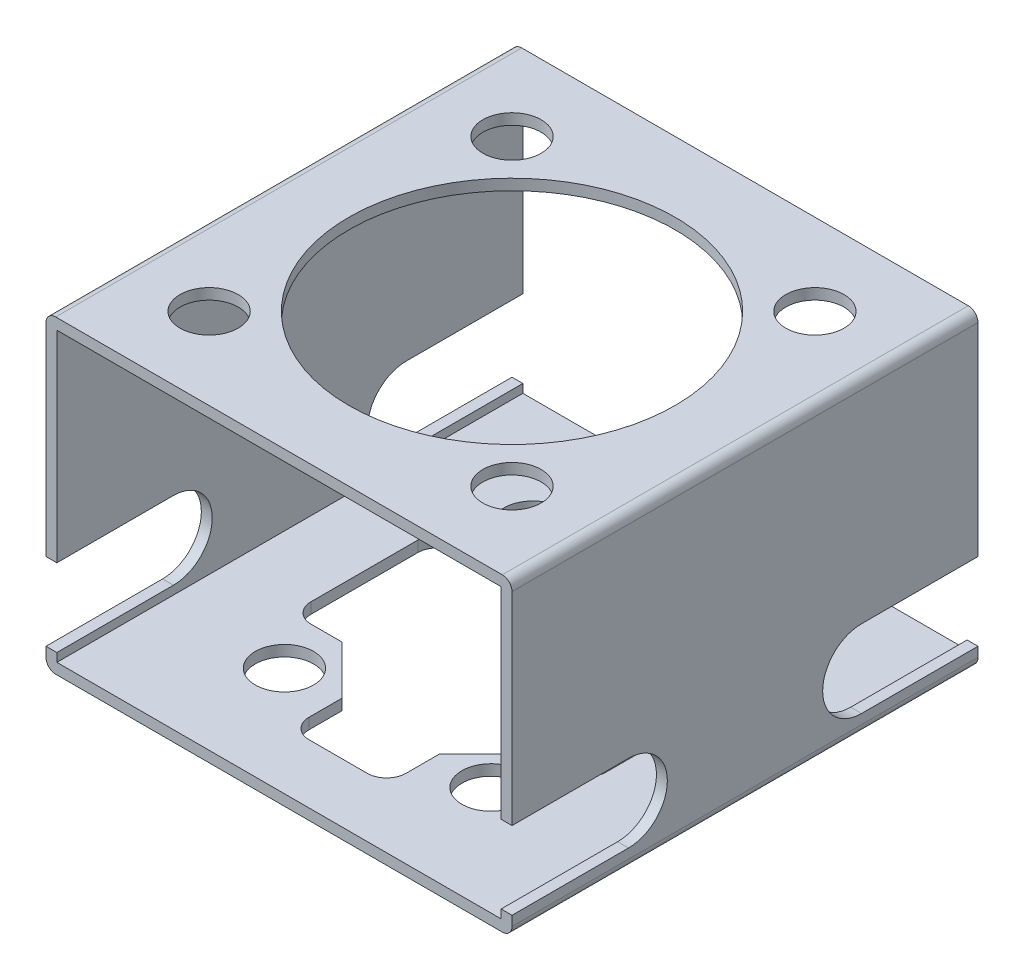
from build123d import *

# Parameters (mm, degrees)
SKETCH1_W          = 72.644
SKETCH1_H          = 47.0408
EXTRUDE1_DEPTH     = 38.1
CUT_EXTRUDE4_DEPTH = 100.086256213
SKETCH3_R          = 26.67
SKETCH3_R_2        = 4.7625
CUT_EXTRUDE5_DEPTH = 1.778
SKETCH4_R          = 4.7625
CUT_EXTRUDE6_DEPTH = 1.778
CUT_EXTRUDE7_DEPTH = 1.778
FILLET1_R          = 3.175


with BuildPart() as part:
    # Sketch1 → Extrude1 (new, symmetric)
    with BuildSketch(Plane.XY):
        with BuildLine():
            Line((1.5875, 0), (74.6125, 0))
            ThreePointArc((74.6125, 0), (75.735032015, 0.464967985), (76.2, 1.5875))
            Line((76.2, 1.5875), (76.2, 49.0093))
            ThreePointArc((76.2, 49.0093), (75.735032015, 50.131832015), (74.6125, 50.5968))
            Line((74.6125, 50.5968), (1.5875, 50.5968))
            ThreePointArc((1.5875, 50.5968), (0.464967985, 50.131832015), (0, 49.0093))
            Line((0, 49.0093), (0, 1.5875))
            ThreePointArc((0, 1.5875), (0.464967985, 0.464967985), (1.5875, 0))
        make_face()
        with Locations((38.1, 25.2984)):
            Rectangle(SKETCH1_W, SKETCH1_H, mode=Mode.SUBTRACT)
    extrude(amount=EXTRUDE1_DEPTH, both=True)

    # Sketch2 → Cut-Extrude4 (cut, through all)
    with BuildSketch(Plane(origin=(0, 0, 0), x_dir=(0, 0, -1), z_dir=(1, 0, 0))):
        with BuildLine():
            Line((-38.1, 15.875), (-19.05, 15.875))
            ThreePointArc((-19.05, 15.875), (-12.7, 9.525), (-19.05, 3.175))
            Line((-19.05, 3.175), (-38.1, 3.175))
            Line((-38.1, 3.175), (-38.1, 15.875))
        make_face()
    cut_extrude4 = extrude(amount=CUT_EXTRUDE4_DEPTH, mode=Mode.SUBTRACT)

    # Mirror1: Cut-Extrude4 across plane
    add(cut_extrude4.mirror(Plane.XY), mode=Mode.SUBTRACT)

    # Sketch3 → Cut-Extrude5 (cut)
    with BuildSketch(Plane(origin=(0, 50.5968, 0), x_dir=(-1, 0, 0), z_dir=(0, 1, 0))):
        with Locations(Location((-38.1, 0, 0), (0, 0, 90))):
            Circle(SKETCH3_R)
        with Locations(Location((-13.335, -24.765, 0), (0, 0, 90))):
            Circle(SKETCH3_R_2)
        with Locations(Location((-62.865, -24.765, 0), (0, 0, 90))):
            Circle(SKETCH3_R_2)
        with Locations(Location((-62.865, 24.765, 0), (0, 0, 90))):
            Circle(SKETCH3_R_2)
        with Locations(Location((-13.335, 24.765, 0), (0, 0, 90))):
            Circle(SKETCH3_R_2)
    extrude(amount=-CUT_EXTRUDE5_DEPTH, mode=Mode.SUBTRACT)

    # Sketch4 → Cut-Extrude6 (cut)
    with BuildSketch(Plane.XZ):
        with Locations(Location((21.209, 20.32, 0), (0, 0, 270))):
            Circle(SKETCH4_R)
        with Locations(Location((54.991, 20.32, 0), (0, 0, 270))):
            Circle(SKETCH4_R)
        with Locations(Location((54.991, -20.32, 0), (0, 0, 270))):
            Circle(SKETCH4_R)
        with Locations(Location((21.209, -20.32, 0), (0, 0, 270))):
            Circle(SKETCH4_R)
    extrude(amount=-CUT_EXTRUDE6_DEPTH, mode=Mode.SUBTRACT)

    # Sketch5 → Cut-Extrude7 (cut)
    with BuildSketch(Plane.XZ):
        Polygon((13.97, 11.90625), (22.225, 11.90625), (30.1625, 19.84375), (30.1625, 28.4353), (46.0375, 28.4353), (46.0375, 19.84375), (53.975, 11.90625), (62.23, 11.90625), (62.23, -11.90625), (53.975, -11.90625), (46.0375, -19.84375), (46.0375, -28.4353), (30.1625, -28.4353), (30.1625, -19.84375), (22.225, -11.90625), (13.97, -11.90625), align=None)
    extrude(amount=-CUT_EXTRUDE7_DEPTH, mode=Mode.SUBTRACT)

    # Fillet1
    fillet1_edges = [part.edges().sort_by_distance(p)[0] for p in [
        (30.1625, 0.889, 28.4353),
        (46.0375, 0.889, 28.4353),
        (62.23, 0.889, 11.90625),
        (62.23, 0.889, -11.90625),
        (46.0375, 0.889, -28.4353),
        (30.1625, 0.889, -28.4353),
        (13.97, 0.889, -11.90625),
        (13.97, 0.889, 11.90625),
    ]]
    fillet(fillet1_edges, radius=FILLET1_R)


solid = part.part
